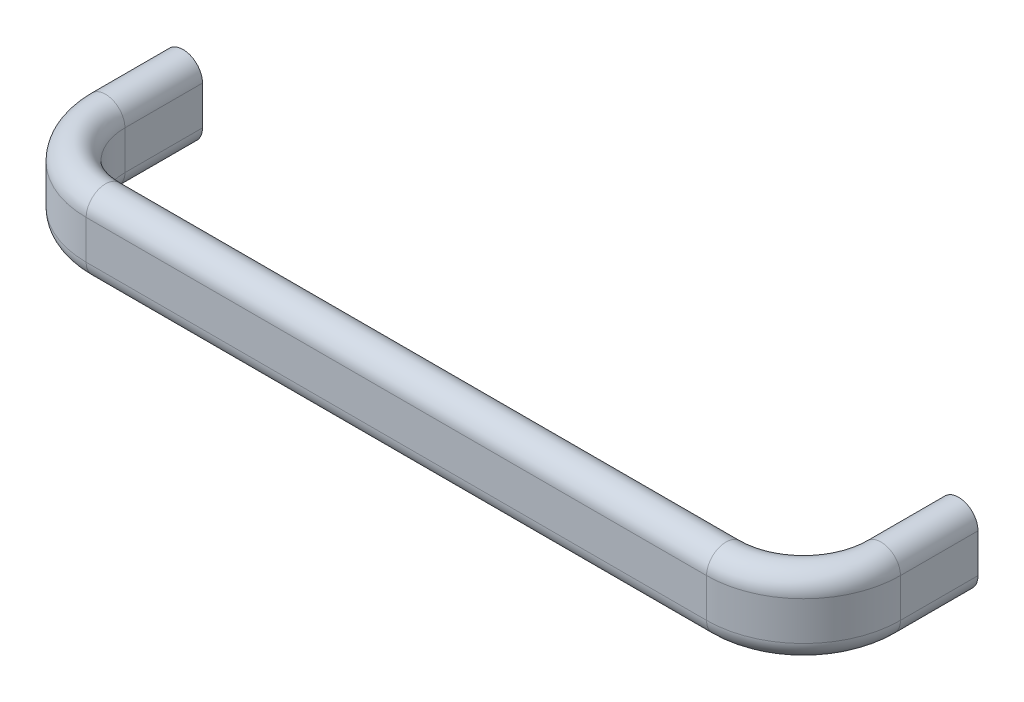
ISO-10303-21;
HEADER;
FILE_DESCRIPTION(('STEP AP214'),'2;1');
FILE_NAME('part.step','',(''),(''),'','','');
FILE_SCHEMA(('AUTOMOTIVE_DESIGN { 1 0 10303 214 1 1 1 1 }'));
ENDSEC;
DATA;
#1=APPLICATION_CONTEXT('core data for automotive mechanical design processes');
#2=APPLICATION_PROTOCOL_DEFINITION('international standard','automotive_design',2000,#1);
#3=PRODUCT_CONTEXT('',#1,'mechanical');
#4=PRODUCT('Part','Part','',(#3));
#5=PRODUCT_RELATED_PRODUCT_CATEGORY('part','',(#4));
#6=PRODUCT_DEFINITION_FORMATION('','',#4);
#7=PRODUCT_DEFINITION_CONTEXT('part definition',#1,'design');
#8=PRODUCT_DEFINITION('design','',#6,#7);
#9=PRODUCT_DEFINITION_SHAPE('','',#8);
#10=(LENGTH_UNIT() NAMED_UNIT(*) SI_UNIT(.MILLI.,.METRE.));
#11=(NAMED_UNIT(*) PLANE_ANGLE_UNIT() SI_UNIT($,.RADIAN.));
#12=(NAMED_UNIT(*) SI_UNIT($,.STERADIAN.) SOLID_ANGLE_UNIT());
#13=UNCERTAINTY_MEASURE_WITH_UNIT(LENGTH_MEASURE(1.E-05),#10,'distance_accuracy_value','');
#14=(GEOMETRIC_REPRESENTATION_CONTEXT(3) GLOBAL_UNCERTAINTY_ASSIGNED_CONTEXT((#13)) GLOBAL_UNIT_ASSIGNED_CONTEXT((#10,
#11,#12)) REPRESENTATION_CONTEXT('',''));
#15=CARTESIAN_POINT('',(0.,0.,0.));
#16=DIRECTION('',(0.,0.,1.));
#17=DIRECTION('',(1.,0.,0.));
#18=AXIS2_PLACEMENT_3D('',#15,#16,#17);
#19=CARTESIAN_POINT('',(-5.,-5.,19.9999999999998));
#20=DIRECTION('',(-1.,0.,0.));
#21=DIRECTION('',(0.,-1.,0.));
#22=AXIS2_PLACEMENT_3D('',#19,#20,#21);
#23=PLANE('',#22);
#24=DIRECTION('',(0.,1.,0.));
#25=VECTOR('',#24,1.);
#26=CARTESIAN_POINT('',(-5.,-5.,19.9999999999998));
#27=LINE('',#26,#25);
#28=CARTESIAN_POINT('',(-5.,-5.,19.9999999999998));
#29=VERTEX_POINT('',#28);
#30=CARTESIAN_POINT('',(-5.,4.99999999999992,19.9999999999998));
#31=VERTEX_POINT('',#30);
#32=EDGE_CURVE('E200',#29,#31,#27,.T.);
#33=ORIENTED_EDGE('',*,*,#32,.T.);
#34=DIRECTION('',(0.,0.,-1.));
#35=VECTOR('',#34,1.);
#36=CARTESIAN_POINT('',(-5.,4.99999999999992,19.9999999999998));
#37=LINE('',#36,#35);
#38=CARTESIAN_POINT('',(-5.,4.99999999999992,-2.06535092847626E-13));
#39=VERTEX_POINT('',#38);
#40=EDGE_CURVE('E224',#31,#39,#37,.T.);
#41=ORIENTED_EDGE('',*,*,#40,.T.);
#42=DIRECTION('',(0.,1.,0.));
#43=VECTOR('',#42,1.);
#44=CARTESIAN_POINT('',(-5.,-5.,-2.06535092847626E-13));
#45=LINE('',#44,#43);
#46=CARTESIAN_POINT('',(-5.,-5.,-2.06535092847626E-13));
#47=VERTEX_POINT('',#46);
#48=EDGE_CURVE('E222',#47,#39,#45,.T.);
#49=ORIENTED_EDGE('',*,*,#48,.F.);
#50=DIRECTION('',(0.,0.,-1.));
#51=VECTOR('',#50,1.);
#52=CARTESIAN_POINT('',(-5.,-5.,19.9999999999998));
#53=LINE('',#52,#51);
#54=EDGE_CURVE('E227',#29,#47,#53,.T.);
#55=ORIENTED_EDGE('',*,*,#54,.F.);
#56=EDGE_LOOP('',(#33,#41,#49,#55));
#57=FACE_BOUND('',#56,.T.);
#58=ADVANCED_FACE('F14',(#57),#23,.T.);
#59=CARTESIAN_POINT('',(0.,4.99999999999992,19.9999999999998));
#60=DIRECTION('',(0.,0.,-1.));
#61=DIRECTION('',(0.,-1.,0.));
#62=AXIS2_PLACEMENT_3D('',#59,#60,#61);
#63=CYLINDRICAL_SURFACE('',#62,5.);
#64=CARTESIAN_POINT('',(0.,4.99999999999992,19.9999999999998));
#65=DIRECTION('',(0.,0.,-1.));
#66=DIRECTION('',(0.,1.,0.));
#67=AXIS2_PLACEMENT_3D('',#64,#65,#66);
#68=CIRCLE('',#67,5.);
#69=CARTESIAN_POINT('',(5.,5.,19.9999999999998));
#70=VERTEX_POINT('',#69);
#71=EDGE_CURVE('E213',#31,#70,#68,.T.);
#72=ORIENTED_EDGE('',*,*,#71,.T.);
#73=DIRECTION('',(0.,0.,-1.));
#74=VECTOR('',#73,1.);
#75=CARTESIAN_POINT('',(5.,5.,19.9999999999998));
#76=LINE('',#75,#74);
#77=CARTESIAN_POINT('',(5.,5.,-2.34290668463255E-13));
#78=VERTEX_POINT('',#77);
#79=EDGE_CURVE('E221',#70,#78,#76,.T.);
#80=ORIENTED_EDGE('',*,*,#79,.T.);
#81=CARTESIAN_POINT('',(0.,4.99999999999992,-2.2041288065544E-13));
#82=DIRECTION('',(0.,0.,-1.));
#83=DIRECTION('',(0.,1.,0.));
#84=AXIS2_PLACEMENT_3D('',#81,#82,#83);
#85=CIRCLE('',#84,5.);
#86=EDGE_CURVE('E36',#39,#78,#85,.T.);
#87=ORIENTED_EDGE('',*,*,#86,.F.);
#88=ORIENTED_EDGE('',*,*,#40,.F.);
#89=EDGE_LOOP('',(#72,#80,#87,#88));
#90=FACE_BOUND('',#89,.T.);
#91=ADVANCED_FACE('F272',(#90),#63,.T.);
#92=CARTESIAN_POINT('',(5.,5.,19.9999999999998));
#93=DIRECTION('',(1.,0.,0.));
#94=DIRECTION('',(0.,1.,0.));
#95=AXIS2_PLACEMENT_3D('',#92,#93,#94);
#96=PLANE('',#95);
#97=DIRECTION('',(0.,-1.,0.));
#98=VECTOR('',#97,1.);
#99=CARTESIAN_POINT('',(5.,5.,19.9999999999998));
#100=LINE('',#99,#98);
#101=CARTESIAN_POINT('',(5.,-5.,19.9999999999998));
#102=VERTEX_POINT('',#101);
#103=EDGE_CURVE('E210',#70,#102,#100,.T.);
#104=ORIENTED_EDGE('',*,*,#103,.T.);
#105=DIRECTION('',(0.,0.,-1.));
#106=VECTOR('',#105,1.);
#107=CARTESIAN_POINT('',(5.,-5.,19.9999999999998));
#108=LINE('',#107,#106);
#109=CARTESIAN_POINT('',(5.,-5.,-2.34290668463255E-13));
#110=VERTEX_POINT('',#109);
#111=EDGE_CURVE('E218',#102,#110,#108,.T.);
#112=ORIENTED_EDGE('',*,*,#111,.T.);
#113=DIRECTION('',(0.,-1.,0.));
#114=VECTOR('',#113,1.);
#115=CARTESIAN_POINT('',(5.,5.,-2.34290668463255E-13));
#116=LINE('',#115,#114);
#117=EDGE_CURVE('E231',#78,#110,#116,.T.);
#118=ORIENTED_EDGE('',*,*,#117,.F.);
#119=ORIENTED_EDGE('',*,*,#79,.F.);
#120=EDGE_LOOP('',(#104,#112,#118,#119));
#121=FACE_BOUND('',#120,.T.);
#122=ADVANCED_FACE('F278',(#121),#96,.T.);
#123=CARTESIAN_POINT('',(0.,-5.,19.9999999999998));
#124=DIRECTION('',(0.,0.,-1.));
#125=DIRECTION('',(0.,-1.,0.));
#126=AXIS2_PLACEMENT_3D('',#123,#124,#125);
#127=CYLINDRICAL_SURFACE('',#126,5.);
#128=CARTESIAN_POINT('',(0.,-5.,19.9999999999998));
#129=DIRECTION('',(0.,0.,-1.));
#130=DIRECTION('',(0.,1.,0.));
#131=AXIS2_PLACEMENT_3D('',#128,#129,#130);
#132=CIRCLE('',#131,5.);
#133=EDGE_CURVE('E186',#102,#29,#132,.T.);
#134=ORIENTED_EDGE('',*,*,#133,.T.);
#135=ORIENTED_EDGE('',*,*,#54,.T.);
#136=CARTESIAN_POINT('',(0.,-5.,-2.2041288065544E-13));
#137=DIRECTION('',(0.,0.,-1.));
#138=DIRECTION('',(0.,1.,0.));
#139=AXIS2_PLACEMENT_3D('',#136,#137,#138);
#140=CIRCLE('',#139,5.);
#141=EDGE_CURVE('E28',#110,#47,#140,.T.);
#142=ORIENTED_EDGE('',*,*,#141,.F.);
#143=ORIENTED_EDGE('',*,*,#111,.F.);
#144=EDGE_LOOP('',(#134,#135,#142,#143));
#145=FACE_BOUND('',#144,.T.);
#146=ADVANCED_FACE('F297',(#145),#127,.T.);
#147=CARTESIAN_POINT('',(20.,0.,19.9999999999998));
#148=DIRECTION('',(0.,-1.,0.));
#149=DIRECTION('',(1.,0.,0.));
#150=AXIS2_PLACEMENT_3D('',#147,#148,#149);
#151=CYLINDRICAL_SURFACE('',#150,25.);
#152=DIRECTION('',(0.,1.,0.));
#153=VECTOR('',#152,1.);
#154=CARTESIAN_POINT('',(20.,-5.,45.));
#155=LINE('',#154,#153);
#156=CARTESIAN_POINT('',(20.,-5.,45.));
#157=VERTEX_POINT('',#156);
#158=CARTESIAN_POINT('',(20.,4.99999999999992,45.));
#159=VERTEX_POINT('',#158);
#160=EDGE_CURVE('E177',#157,#159,#155,.T.);
#161=ORIENTED_EDGE('',*,*,#160,.T.);
#162=CARTESIAN_POINT('',(20.,4.99999999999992,19.9999999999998));
#163=DIRECTION('',(0.,-1.,0.));
#164=DIRECTION('',(1.,0.,0.));
#165=AXIS2_PLACEMENT_3D('',#162,#163,#164);
#166=CIRCLE('',#165,25.);
#167=EDGE_CURVE('E203',#159,#31,#166,.T.);
#168=ORIENTED_EDGE('',*,*,#167,.T.);
#169=ORIENTED_EDGE('',*,*,#32,.F.);
#170=CARTESIAN_POINT('',(20.,-5.,19.9999999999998));
#171=DIRECTION('',(0.,-1.,0.));
#172=DIRECTION('',(1.,0.,0.));
#173=AXIS2_PLACEMENT_3D('',#170,#171,#172);
#174=CIRCLE('',#173,25.);
#175=EDGE_CURVE('E206',#157,#29,#174,.T.);
#176=ORIENTED_EDGE('',*,*,#175,.F.);
#177=EDGE_LOOP('',(#161,#168,#169,#176));
#178=FACE_BOUND('',#177,.T.);
#179=ADVANCED_FACE('F284',(#178),#151,.T.);
#180=CARTESIAN_POINT('',(20.,4.99999999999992,19.9999999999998));
#181=DIRECTION('',(0.,-1.,0.));
#182=DIRECTION('',(1.,0.,0.));
#183=AXIS2_PLACEMENT_3D('',#180,#181,#182);
#184=TOROIDAL_SURFACE('',#183,20.,5.);
#185=CARTESIAN_POINT('',(20.,4.99999999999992,40.));
#186=DIRECTION('',(-1.,0.,0.));
#187=DIRECTION('',(0.,1.,0.));
#188=AXIS2_PLACEMENT_3D('',#185,#186,#187);
#189=CIRCLE('',#188,5.);
#190=CARTESIAN_POINT('',(20.,5.,35.));
#191=VERTEX_POINT('',#190);
#192=EDGE_CURVE('E191',#159,#191,#189,.T.);
#193=ORIENTED_EDGE('',*,*,#192,.T.);
#194=CARTESIAN_POINT('',(20.,5.,19.9999999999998));
#195=DIRECTION('',(0.,-1.,0.));
#196=DIRECTION('',(1.,0.,0.));
#197=AXIS2_PLACEMENT_3D('',#194,#195,#196);
#198=CIRCLE('',#197,15.);
#199=EDGE_CURVE('E199',#191,#70,#198,.T.);
#200=ORIENTED_EDGE('',*,*,#199,.T.);
#201=ORIENTED_EDGE('',*,*,#71,.F.);
#202=ORIENTED_EDGE('',*,*,#167,.F.);
#203=EDGE_LOOP('',(#193,#200,#201,#202));
#204=FACE_BOUND('',#203,.T.);
#205=ADVANCED_FACE('F287',(#204),#184,.T.);
#206=CARTESIAN_POINT('',(20.,0.,19.9999999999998));
#207=DIRECTION('',(0.,-1.,0.));
#208=DIRECTION('',(1.,0.,0.));
#209=AXIS2_PLACEMENT_3D('',#206,#207,#208);
#210=CYLINDRICAL_SURFACE('',#209,15.);
#211=DIRECTION('',(0.,-1.,0.));
#212=VECTOR('',#211,1.);
#213=CARTESIAN_POINT('',(20.,5.,35.));
#214=LINE('',#213,#212);
#215=CARTESIAN_POINT('',(20.,-5.,35.));
#216=VERTEX_POINT('',#215);
#217=EDGE_CURVE('E188',#191,#216,#214,.T.);
#218=ORIENTED_EDGE('',*,*,#217,.T.);
#219=CARTESIAN_POINT('',(20.,-5.,19.9999999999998));
#220=DIRECTION('',(0.,-1.,0.));
#221=DIRECTION('',(1.,0.,0.));
#222=AXIS2_PLACEMENT_3D('',#219,#220,#221);
#223=CIRCLE('',#222,15.);
#224=EDGE_CURVE('E196',#216,#102,#223,.T.);
#225=ORIENTED_EDGE('',*,*,#224,.T.);
#226=ORIENTED_EDGE('',*,*,#103,.F.);
#227=ORIENTED_EDGE('',*,*,#199,.F.);
#228=EDGE_LOOP('',(#218,#225,#226,#227));
#229=FACE_BOUND('',#228,.T.);
#230=ADVANCED_FACE('F291',(#229),#210,.F.);
#231=CARTESIAN_POINT('',(20.,-5.,19.9999999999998));
#232=DIRECTION('',(0.,-1.,0.));
#233=DIRECTION('',(1.,0.,0.));
#234=AXIS2_PLACEMENT_3D('',#231,#232,#233);
#235=TOROIDAL_SURFACE('',#234,20.,5.);
#236=CARTESIAN_POINT('',(20.,-5.,40.));
#237=DIRECTION('',(-1.,0.,0.));
#238=DIRECTION('',(0.,1.,0.));
#239=AXIS2_PLACEMENT_3D('',#236,#237,#238);
#240=CIRCLE('',#239,5.);
#241=EDGE_CURVE('E163',#216,#157,#240,.T.);
#242=ORIENTED_EDGE('',*,*,#241,.T.);
#243=ORIENTED_EDGE('',*,*,#175,.T.);
#244=ORIENTED_EDGE('',*,*,#133,.F.);
#245=ORIENTED_EDGE('',*,*,#224,.F.);
#246=EDGE_LOOP('',(#242,#243,#244,#245));
#247=FACE_BOUND('',#246,.T.);
#248=ADVANCED_FACE('F295',(#247),#235,.T.);
#249=CARTESIAN_POINT('',(180.,-5.,45.));
#250=DIRECTION('',(0.,0.,1.));
#251=DIRECTION('',(1.,0.,0.));
#252=AXIS2_PLACEMENT_3D('',#249,#250,#251);
#253=PLANE('',#252);
#254=DIRECTION('',(0.,1.,0.));
#255=VECTOR('',#254,1.);
#256=CARTESIAN_POINT('',(180.,-5.,45.));
#257=LINE('',#256,#255);
#258=CARTESIAN_POINT('',(180.,-5.,45.));
#259=VERTEX_POINT('',#258);
#260=CARTESIAN_POINT('',(180.,4.99999999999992,45.));
#261=VERTEX_POINT('',#260);
#262=EDGE_CURVE('E154',#259,#261,#257,.T.);
#263=ORIENTED_EDGE('',*,*,#262,.T.);
#264=DIRECTION('',(-1.,0.,0.));
#265=VECTOR('',#264,1.);
#266=CARTESIAN_POINT('',(180.,4.99999999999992,45.));
#267=LINE('',#266,#265);
#268=EDGE_CURVE('E180',#261,#159,#267,.T.);
#269=ORIENTED_EDGE('',*,*,#268,.T.);
#270=ORIENTED_EDGE('',*,*,#160,.F.);
#271=DIRECTION('',(-1.,0.,0.));
#272=VECTOR('',#271,1.);
#273=CARTESIAN_POINT('',(180.,-5.,45.));
#274=LINE('',#273,#272);
#275=EDGE_CURVE('E183',#259,#157,#274,.T.);
#276=ORIENTED_EDGE('',*,*,#275,.F.);
#277=EDGE_LOOP('',(#263,#269,#270,#276));
#278=FACE_BOUND('',#277,.T.);
#279=ADVANCED_FACE('F353',(#278),#253,.T.);
#280=CARTESIAN_POINT('',(180.,4.99999999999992,40.));
#281=DIRECTION('',(-1.,0.,0.));
#282=DIRECTION('',(0.,0.,1.));
#283=AXIS2_PLACEMENT_3D('',#280,#281,#282);
#284=CYLINDRICAL_SURFACE('',#283,5.);
#285=CARTESIAN_POINT('',(180.,4.99999999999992,40.));
#286=DIRECTION('',(-1.,0.,0.));
#287=DIRECTION('',(0.,1.,0.));
#288=AXIS2_PLACEMENT_3D('',#285,#286,#287);
#289=CIRCLE('',#288,5.);
#290=CARTESIAN_POINT('',(180.,5.,35.));
#291=VERTEX_POINT('',#290);
#292=EDGE_CURVE('E168',#261,#291,#289,.T.);
#293=ORIENTED_EDGE('',*,*,#292,.T.);
#294=DIRECTION('',(-1.,0.,0.));
#295=VECTOR('',#294,1.);
#296=CARTESIAN_POINT('',(180.,5.,35.));
#297=LINE('',#296,#295);
#298=EDGE_CURVE('E176',#291,#191,#297,.T.);
#299=ORIENTED_EDGE('',*,*,#298,.T.);
#300=ORIENTED_EDGE('',*,*,#192,.F.);
#301=ORIENTED_EDGE('',*,*,#268,.F.);
#302=EDGE_LOOP('',(#293,#299,#300,#301));
#303=FACE_BOUND('',#302,.T.);
#304=ADVANCED_FACE('F349',(#303),#284,.T.);
#305=CARTESIAN_POINT('',(180.,5.,35.));
#306=DIRECTION('',(0.,0.,-1.));
#307=DIRECTION('',(-1.,0.,0.));
#308=AXIS2_PLACEMENT_3D('',#305,#306,#307);
#309=PLANE('',#308);
#310=DIRECTION('',(0.,-1.,0.));
#311=VECTOR('',#310,1.);
#312=CARTESIAN_POINT('',(180.,5.,35.));
#313=LINE('',#312,#311);
#314=CARTESIAN_POINT('',(180.,-5.,35.));
#315=VERTEX_POINT('',#314);
#316=EDGE_CURVE('E165',#291,#315,#313,.T.);
#317=ORIENTED_EDGE('',*,*,#316,.T.);
#318=DIRECTION('',(-1.,0.,0.));
#319=VECTOR('',#318,1.);
#320=CARTESIAN_POINT('',(180.,-5.,35.));
#321=LINE('',#320,#319);
#322=EDGE_CURVE('E173',#315,#216,#321,.T.);
#323=ORIENTED_EDGE('',*,*,#322,.T.);
#324=ORIENTED_EDGE('',*,*,#217,.F.);
#325=ORIENTED_EDGE('',*,*,#298,.F.);
#326=EDGE_LOOP('',(#317,#323,#324,#325));
#327=FACE_BOUND('',#326,.T.);
#328=ADVANCED_FACE('F345',(#327),#309,.T.);
#329=CARTESIAN_POINT('',(180.,-5.,40.));
#330=DIRECTION('',(-1.,0.,0.));
#331=DIRECTION('',(0.,0.,1.));
#332=AXIS2_PLACEMENT_3D('',#329,#330,#331);
#333=CYLINDRICAL_SURFACE('',#332,5.);
#334=CARTESIAN_POINT('',(180.,-5.,40.));
#335=DIRECTION('',(-1.,0.,0.));
#336=DIRECTION('',(0.,1.,0.));
#337=AXIS2_PLACEMENT_3D('',#334,#335,#336);
#338=CIRCLE('',#337,5.);
#339=EDGE_CURVE('E126',#315,#259,#338,.T.);
#340=ORIENTED_EDGE('',*,*,#339,.T.);
#341=ORIENTED_EDGE('',*,*,#275,.T.);
#342=ORIENTED_EDGE('',*,*,#241,.F.);
#343=ORIENTED_EDGE('',*,*,#322,.F.);
#344=EDGE_LOOP('',(#340,#341,#342,#343));
#345=FACE_BOUND('',#344,.T.);
#346=ADVANCED_FACE('F341',(#345),#333,.T.);
#347=CARTESIAN_POINT('',(180.,0.,19.9999999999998));
#348=DIRECTION('',(0.,-1.,0.));
#349=DIRECTION('',(1.,0.,0.));
#350=AXIS2_PLACEMENT_3D('',#347,#348,#349);
#351=CYLINDRICAL_SURFACE('',#350,25.);
#352=DIRECTION('',(0.,1.,0.));
#353=VECTOR('',#352,1.);
#354=CARTESIAN_POINT('',(205.,-5.,19.9999999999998));
#355=LINE('',#354,#353);
#356=CARTESIAN_POINT('',(205.,-5.,19.9999999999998));
#357=VERTEX_POINT('',#356);
#358=CARTESIAN_POINT('',(205.,4.99999999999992,19.9999999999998));
#359=VERTEX_POINT('',#358);
#360=EDGE_CURVE('E125',#357,#359,#355,.T.);
#361=ORIENTED_EDGE('',*,*,#360,.T.);
#362=CARTESIAN_POINT('',(180.,4.99999999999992,19.9999999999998));
#363=DIRECTION('',(0.,-1.,0.));
#364=DIRECTION('',(1.,0.,0.));
#365=AXIS2_PLACEMENT_3D('',#362,#363,#364);
#366=CIRCLE('',#365,25.);
#367=EDGE_CURVE('E157',#359,#261,#366,.T.);
#368=ORIENTED_EDGE('',*,*,#367,.T.);
#369=ORIENTED_EDGE('',*,*,#262,.F.);
#370=CARTESIAN_POINT('',(180.,-5.,19.9999999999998));
#371=DIRECTION('',(0.,-1.,0.));
#372=DIRECTION('',(1.,0.,0.));
#373=AXIS2_PLACEMENT_3D('',#370,#371,#372);
#374=CIRCLE('',#373,25.);
#375=EDGE_CURVE('E160',#357,#259,#374,.T.);
#376=ORIENTED_EDGE('',*,*,#375,.F.);
#377=EDGE_LOOP('',(#361,#368,#369,#376));
#378=FACE_BOUND('',#377,.T.);
#379=ADVANCED_FACE('F337',(#378),#351,.T.);
#380=CARTESIAN_POINT('',(180.,4.99999999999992,19.9999999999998));
#381=DIRECTION('',(0.,-1.,0.));
#382=DIRECTION('',(1.,0.,0.));
#383=AXIS2_PLACEMENT_3D('',#380,#381,#382);
#384=TOROIDAL_SURFACE('',#383,20.,5.);
#385=CARTESIAN_POINT('',(200.,4.99999999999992,19.9999999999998));
#386=DIRECTION('',(0.,0.,1.));
#387=DIRECTION('',(0.,1.,0.));
#388=AXIS2_PLACEMENT_3D('',#385,#386,#387);
#389=CIRCLE('',#388,5.);
#390=CARTESIAN_POINT('',(195.,5.,19.9999999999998));
#391=VERTEX_POINT('',#390);
#392=EDGE_CURVE('E140',#359,#391,#389,.T.);
#393=ORIENTED_EDGE('',*,*,#392,.T.);
#394=CARTESIAN_POINT('',(180.,5.,19.9999999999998));
#395=DIRECTION('',(0.,-1.,0.));
#396=DIRECTION('',(1.,0.,0.));
#397=AXIS2_PLACEMENT_3D('',#394,#395,#396);
#398=CIRCLE('',#397,15.);
#399=EDGE_CURVE('E153',#391,#291,#398,.T.);
#400=ORIENTED_EDGE('',*,*,#399,.T.);
#401=ORIENTED_EDGE('',*,*,#292,.F.);
#402=ORIENTED_EDGE('',*,*,#367,.F.);
#403=EDGE_LOOP('',(#393,#400,#401,#402));
#404=FACE_BOUND('',#403,.T.);
#405=ADVANCED_FACE('F333',(#404),#384,.T.);
#406=CARTESIAN_POINT('',(180.,0.,19.9999999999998));
#407=DIRECTION('',(0.,-1.,0.));
#408=DIRECTION('',(1.,0.,0.));
#409=AXIS2_PLACEMENT_3D('',#406,#407,#408);
#410=CYLINDRICAL_SURFACE('',#409,15.);
#411=DIRECTION('',(0.,-1.,0.));
#412=VECTOR('',#411,1.);
#413=CARTESIAN_POINT('',(195.,5.,19.9999999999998));
#414=LINE('',#413,#412);
#415=CARTESIAN_POINT('',(195.,-5.,19.9999999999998));
#416=VERTEX_POINT('',#415);
#417=EDGE_CURVE('E142',#391,#416,#414,.T.);
#418=ORIENTED_EDGE('',*,*,#417,.T.);
#419=CARTESIAN_POINT('',(180.,-5.,19.9999999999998));
#420=DIRECTION('',(0.,-1.,0.));
#421=DIRECTION('',(1.,0.,0.));
#422=AXIS2_PLACEMENT_3D('',#419,#420,#421);
#423=CIRCLE('',#422,15.);
#424=EDGE_CURVE('E150',#416,#315,#423,.T.);
#425=ORIENTED_EDGE('',*,*,#424,.T.);
#426=ORIENTED_EDGE('',*,*,#316,.F.);
#427=ORIENTED_EDGE('',*,*,#399,.F.);
#428=EDGE_LOOP('',(#418,#425,#426,#427));
#429=FACE_BOUND('',#428,.T.);
#430=ADVANCED_FACE('F329',(#429),#410,.F.);
#431=CARTESIAN_POINT('',(180.,-5.,19.9999999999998));
#432=DIRECTION('',(0.,-1.,0.));
#433=DIRECTION('',(1.,0.,0.));
#434=AXIS2_PLACEMENT_3D('',#431,#432,#433);
#435=TOROIDAL_SURFACE('',#434,20.,5.);
#436=CARTESIAN_POINT('',(200.,-5.,19.9999999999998));
#437=DIRECTION('',(0.,0.,1.));
#438=DIRECTION('',(0.,1.,0.));
#439=AXIS2_PLACEMENT_3D('',#436,#437,#438);
#440=CIRCLE('',#439,5.);
#441=EDGE_CURVE('E137',#416,#357,#440,.T.);
#442=ORIENTED_EDGE('',*,*,#441,.T.);
#443=ORIENTED_EDGE('',*,*,#375,.T.);
#444=ORIENTED_EDGE('',*,*,#339,.F.);
#445=ORIENTED_EDGE('',*,*,#424,.F.);
#446=EDGE_LOOP('',(#442,#443,#444,#445));
#447=FACE_BOUND('',#446,.T.);
#448=ADVANCED_FACE('F326',(#447),#435,.T.);
#449=CARTESIAN_POINT('',(200.,-5.,19.9999999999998));
#450=DIRECTION('',(0.,0.,-1.));
#451=DIRECTION('',(-1.,0.,0.));
#452=AXIS2_PLACEMENT_3D('',#449,#450,#451);
#453=CYLINDRICAL_SURFACE('',#452,5.);
#454=DIRECTION('',(0.,0.,-1.));
#455=VECTOR('',#454,1.);
#456=CARTESIAN_POINT('',(205.,-5.,19.9999999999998));
#457=LINE('',#456,#455);
#458=CARTESIAN_POINT('',(205.,-5.,-2.34290668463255E-13));
#459=VERTEX_POINT('',#458);
#460=EDGE_CURVE('E108',#357,#459,#457,.T.);
#461=ORIENTED_EDGE('',*,*,#460,.F.);
#462=ORIENTED_EDGE('',*,*,#441,.F.);
#463=DIRECTION('',(0.,0.,-1.));
#464=VECTOR('',#463,1.);
#465=CARTESIAN_POINT('',(195.,-5.,19.9999999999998));
#466=LINE('',#465,#464);
#467=CARTESIAN_POINT('',(195.,-5.,-2.34290668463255E-13));
#468=VERTEX_POINT('',#467);
#469=EDGE_CURVE('E111',#416,#468,#466,.T.);
#470=ORIENTED_EDGE('',*,*,#469,.T.);
#471=CARTESIAN_POINT('',(200.,-5.,-2.34290668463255E-13));
#472=DIRECTION('',(0.,0.,1.));
#473=DIRECTION('',(0.,1.,0.));
#474=AXIS2_PLACEMENT_3D('',#471,#472,#473);
#475=CIRCLE('',#474,5.);
#476=EDGE_CURVE('E104',#468,#459,#475,.T.);
#477=ORIENTED_EDGE('',*,*,#476,.T.);
#478=EDGE_LOOP('',(#461,#462,#470,#477));
#479=FACE_BOUND('',#478,.T.);
#480=ADVANCED_FACE('F106',(#479),#453,.T.);
#481=CARTESIAN_POINT('',(205.,-5.,19.9999999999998));
#482=DIRECTION('',(-1.,0.,0.));
#483=DIRECTION('',(0.,0.,1.));
#484=AXIS2_PLACEMENT_3D('',#481,#482,#483);
#485=PLANE('',#484);
#486=DIRECTION('',(0.,0.,-1.));
#487=VECTOR('',#486,1.);
#488=CARTESIAN_POINT('',(205.,4.99999999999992,19.9999999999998));
#489=LINE('',#488,#487);
#490=CARTESIAN_POINT('',(205.,4.99999999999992,-2.34290668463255E-13));
#491=VERTEX_POINT('',#490);
#492=EDGE_CURVE('E127',#359,#491,#489,.T.);
#493=ORIENTED_EDGE('',*,*,#492,.F.);
#494=ORIENTED_EDGE('',*,*,#360,.F.);
#495=ORIENTED_EDGE('',*,*,#460,.T.);
#496=DIRECTION('',(0.,1.,0.));
#497=VECTOR('',#496,1.);
#498=CARTESIAN_POINT('',(205.,-5.,-2.34290668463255E-13));
#499=LINE('',#498,#497);
#500=EDGE_CURVE('E116',#459,#491,#499,.T.);
#501=ORIENTED_EDGE('',*,*,#500,.T.);
#502=EDGE_LOOP('',(#493,#494,#495,#501));
#503=FACE_BOUND('',#502,.T.);
#504=ADVANCED_FACE('F122',(#503),#485,.F.);
#505=CARTESIAN_POINT('',(200.,4.99999999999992,19.9999999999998));
#506=DIRECTION('',(0.,0.,-1.));
#507=DIRECTION('',(-1.,0.,0.));
#508=AXIS2_PLACEMENT_3D('',#505,#506,#507);
#509=CYLINDRICAL_SURFACE('',#508,5.);
#510=DIRECTION('',(0.,0.,-1.));
#511=VECTOR('',#510,1.);
#512=CARTESIAN_POINT('',(195.,5.,19.9999999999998));
#513=LINE('',#512,#511);
#514=CARTESIAN_POINT('',(195.,5.,-2.34290668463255E-13));
#515=VERTEX_POINT('',#514);
#516=EDGE_CURVE('E146',#391,#515,#513,.T.);
#517=ORIENTED_EDGE('',*,*,#516,.F.);
#518=ORIENTED_EDGE('',*,*,#392,.F.);
#519=ORIENTED_EDGE('',*,*,#492,.T.);
#520=CARTESIAN_POINT('',(200.,4.99999999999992,-2.34290668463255E-13));
#521=DIRECTION('',(0.,0.,1.));
#522=DIRECTION('',(0.,1.,0.));
#523=AXIS2_PLACEMENT_3D('',#520,#521,#522);
#524=CIRCLE('',#523,5.);
#525=EDGE_CURVE('E130',#491,#515,#524,.T.);
#526=ORIENTED_EDGE('',*,*,#525,.T.);
#527=EDGE_LOOP('',(#517,#518,#519,#526));
#528=FACE_BOUND('',#527,.T.);
#529=ADVANCED_FACE('F303',(#528),#509,.T.);
#530=CARTESIAN_POINT('',(195.,5.,19.9999999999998));
#531=DIRECTION('',(1.,0.,0.));
#532=DIRECTION('',(0.,0.,-1.));
#533=AXIS2_PLACEMENT_3D('',#530,#531,#532);
#534=PLANE('',#533);
#535=ORIENTED_EDGE('',*,*,#417,.F.);
#536=ORIENTED_EDGE('',*,*,#516,.T.);
#537=DIRECTION('',(0.,-1.,0.));
#538=VECTOR('',#537,1.);
#539=CARTESIAN_POINT('',(195.,5.,-2.34290668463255E-13));
#540=LINE('',#539,#538);
#541=EDGE_CURVE('E132',#515,#468,#540,.T.);
#542=ORIENTED_EDGE('',*,*,#541,.T.);
#543=ORIENTED_EDGE('',*,*,#469,.F.);
#544=EDGE_LOOP('',(#535,#536,#542,#543));
#545=FACE_BOUND('',#544,.T.);
#546=ADVANCED_FACE('F300',(#545),#534,.F.);
#547=CARTESIAN_POINT('',(0.,-5.,-2.2041288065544E-13));
#548=DIRECTION('',(0.,0.,-1.));
#549=DIRECTION('',(0.,1.,0.));
#550=AXIS2_PLACEMENT_3D('',#547,#548,#549);
#551=PLANE('',#550);
#552=CARTESIAN_POINT('',(0.,0.,-2.4816845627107E-13));
#553=DIRECTION('',(0.,0.,-1.));
#554=DIRECTION('',(0.,1.,0.));
#555=AXIS2_PLACEMENT_3D('',#552,#553,#554);
#556=CIRCLE('',#555,2.96700000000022);
#557=CARTESIAN_POINT('',(0.,2.96700000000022,-2.4816845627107E-13));
#558=VERTEX_POINT('',#557);
#559=EDGE_CURVE('E249',#558,#558,#556,.T.);
#560=ORIENTED_EDGE('',*,*,#559,.F.);
#561=EDGE_LOOP('',(#560));
#562=FACE_BOUND('',#561,.T.);
#563=ORIENTED_EDGE('',*,*,#141,.T.);
#564=ORIENTED_EDGE('',*,*,#48,.T.);
#565=ORIENTED_EDGE('',*,*,#86,.T.);
#566=ORIENTED_EDGE('',*,*,#117,.T.);
#567=EDGE_LOOP('',(#563,#564,#565,#566));
#568=FACE_BOUND('',#567,.T.);
#569=ADVANCED_FACE('F298',(#562,#568),#551,.T.);
#570=CARTESIAN_POINT('',(200.,-5.,-2.34290668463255E-13));
#571=DIRECTION('',(0.,0.,1.));
#572=DIRECTION('',(0.,1.,0.));
#573=AXIS2_PLACEMENT_3D('',#570,#571,#572);
#574=PLANE('',#573);
#575=CARTESIAN_POINT('',(200.,0.,-2.4816845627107E-13));
#576=DIRECTION('',(0.,0.,1.));
#577=DIRECTION('',(0.,1.,0.));
#578=AXIS2_PLACEMENT_3D('',#575,#576,#577);
#579=CIRCLE('',#578,2.96700000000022);
#580=CARTESIAN_POINT('',(200.,2.96700000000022,-2.4816845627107E-13));
#581=VERTEX_POINT('',#580);
#582=EDGE_CURVE('E117',#581,#581,#579,.T.);
#583=ORIENTED_EDGE('',*,*,#582,.T.);
#584=EDGE_LOOP('',(#583));
#585=FACE_BOUND('',#584,.T.);
#586=ORIENTED_EDGE('',*,*,#476,.F.);
#587=ORIENTED_EDGE('',*,*,#541,.F.);
#588=ORIENTED_EDGE('',*,*,#525,.F.);
#589=ORIENTED_EDGE('',*,*,#500,.F.);
#590=EDGE_LOOP('',(#586,#587,#588,#589));
#591=FACE_BOUND('',#590,.T.);
#592=ADVANCED_FACE('F129',(#585,#591),#574,.F.);
#593=CARTESIAN_POINT('',(200.,0.,0.466999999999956));
#594=DIRECTION('',(0.,0.,-1.));
#595=DIRECTION('',(0.,-1.,0.));
#596=AXIS2_PLACEMENT_3D('',#593,#594,#595);
#597=CONICAL_SURFACE('',#596,2.5,0.785398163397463);
#598=ORIENTED_EDGE('',*,*,#582,.F.);
#599=EDGE_LOOP('',(#598));
#600=FACE_BOUND('',#599,.T.);
#601=CARTESIAN_POINT('',(200.,0.,0.466999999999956));
#602=DIRECTION('',(0.,0.,1.));
#603=DIRECTION('',(0.,1.,0.));
#604=AXIS2_PLACEMENT_3D('',#601,#602,#603);
#605=CIRCLE('',#604,2.5);
#606=CARTESIAN_POINT('',(200.,2.5,0.466999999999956));
#607=VERTEX_POINT('',#606);
#608=EDGE_CURVE('E247',#607,#607,#605,.T.);
#609=ORIENTED_EDGE('',*,*,#608,.T.);
#610=EDGE_LOOP('',(#609));
#611=FACE_BOUND('',#610,.T.);
#612=ADVANCED_FACE('F243',(#600,#611),#597,.F.);
#613=CARTESIAN_POINT('',(200.,0.,15.6933830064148));
#614=DIRECTION('',(0.,0.,1.));
#615=DIRECTION('',(0.,1.,0.));
#616=AXIS2_PLACEMENT_3D('',#613,#614,#615);
#617=CYLINDRICAL_SURFACE('',#616,2.5);
#618=CARTESIAN_POINT('',(200.,0.,9.99999999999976));
#619=DIRECTION('',(0.,0.,-1.));
#620=DIRECTION('',(-1.,0.,0.));
#621=AXIS2_PLACEMENT_3D('',#618,#619,#620);
#622=CIRCLE('',#621,2.5);
#623=CARTESIAN_POINT('',(197.5,0.,9.99999999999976));
#624=VERTEX_POINT('',#623);
#625=EDGE_CURVE('E21',#624,#624,#622,.T.);
#626=ORIENTED_EDGE('',*,*,#625,.F.);
#627=EDGE_LOOP('',(#626));
#628=FACE_BOUND('',#627,.T.);
#629=ORIENTED_EDGE('',*,*,#608,.F.);
#630=EDGE_LOOP('',(#629));
#631=FACE_BOUND('',#630,.T.);
#632=ADVANCED_FACE('F239',(#628,#631),#617,.F.);
#633=CARTESIAN_POINT('',(0.,0.,0.466999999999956));
#634=DIRECTION('',(0.,0.,-1.));
#635=DIRECTION('',(0.,-1.,0.));
#636=AXIS2_PLACEMENT_3D('',#633,#634,#635);
#637=CONICAL_SURFACE('',#636,2.5,0.785398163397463);
#638=ORIENTED_EDGE('',*,*,#559,.T.);
#639=EDGE_LOOP('',(#638));
#640=FACE_BOUND('',#639,.T.);
#641=CARTESIAN_POINT('',(0.,0.,0.466999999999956));
#642=DIRECTION('',(0.,0.,-1.));
#643=DIRECTION('',(0.,1.,0.));
#644=AXIS2_PLACEMENT_3D('',#641,#642,#643);
#645=CIRCLE('',#644,2.5);
#646=CARTESIAN_POINT('',(0.,2.5,0.466999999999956));
#647=VERTEX_POINT('',#646);
#648=EDGE_CURVE('E253',#647,#647,#645,.T.);
#649=ORIENTED_EDGE('',*,*,#648,.F.);
#650=EDGE_LOOP('',(#649));
#651=FACE_BOUND('',#650,.T.);
#652=ADVANCED_FACE('F242',(#640,#651),#637,.F.);
#653=CARTESIAN_POINT('',(0.,0.,15.6933830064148));
#654=DIRECTION('',(0.,0.,1.));
#655=DIRECTION('',(0.,1.,0.));
#656=AXIS2_PLACEMENT_3D('',#653,#654,#655);
#657=CYLINDRICAL_SURFACE('',#656,2.5);
#658=CARTESIAN_POINT('',(0.,0.,9.99999999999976));
#659=DIRECTION('',(0.,0.,-1.));
#660=DIRECTION('',(-1.,0.,0.));
#661=AXIS2_PLACEMENT_3D('',#658,#659,#660);
#662=CIRCLE('',#661,2.5);
#663=CARTESIAN_POINT('',(-2.5,0.,9.99999999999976));
#664=VERTEX_POINT('',#663);
#665=EDGE_CURVE('E9',#664,#664,#662,.T.);
#666=ORIENTED_EDGE('',*,*,#665,.F.);
#667=EDGE_LOOP('',(#666));
#668=FACE_BOUND('',#667,.T.);
#669=ORIENTED_EDGE('',*,*,#648,.T.);
#670=EDGE_LOOP('',(#669));
#671=FACE_BOUND('',#670,.T.);
#672=ADVANCED_FACE('F259',(#668,#671),#657,.F.);
#673=CARTESIAN_POINT('',(200.,0.,9.99999999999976));
#674=DIRECTION('',(0.,0.,-1.));
#675=DIRECTION('',(-1.,0.,0.));
#676=AXIS2_PLACEMENT_3D('',#673,#674,#675);
#677=PLANE('',#676);
#678=ORIENTED_EDGE('',*,*,#625,.T.);
#679=EDGE_LOOP('',(#678));
#680=FACE_BOUND('',#679,.T.);
#681=ADVANCED_FACE('F237',(#680),#677,.T.);
#682=CARTESIAN_POINT('',(0.,0.,9.99999999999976));
#683=DIRECTION('',(0.,0.,-1.));
#684=DIRECTION('',(-1.,0.,0.));
#685=AXIS2_PLACEMENT_3D('',#682,#683,#684);
#686=PLANE('',#685);
#687=ORIENTED_EDGE('',*,*,#665,.T.);
#688=EDGE_LOOP('',(#687));
#689=FACE_BOUND('',#688,.T.);
#690=ADVANCED_FACE('F512',(#689),#686,.T.);
#691=CLOSED_SHELL('',(#58,#91,#122,#146,#179,#205,#230,#248,#279,#304,#328,#346,#379,#405,#430,
#448,#480,#504,#529,#546,#569,#592,#612,#632,#652,#672,#681,#690));
#692=MANIFOLD_SOLID_BREP('B1',#691);
#693=ADVANCED_BREP_SHAPE_REPRESENTATION('',(#18,#692),#14);
#694=SHAPE_DEFINITION_REPRESENTATION(#9,#693);
ENDSEC;
END-ISO-10303-21;
